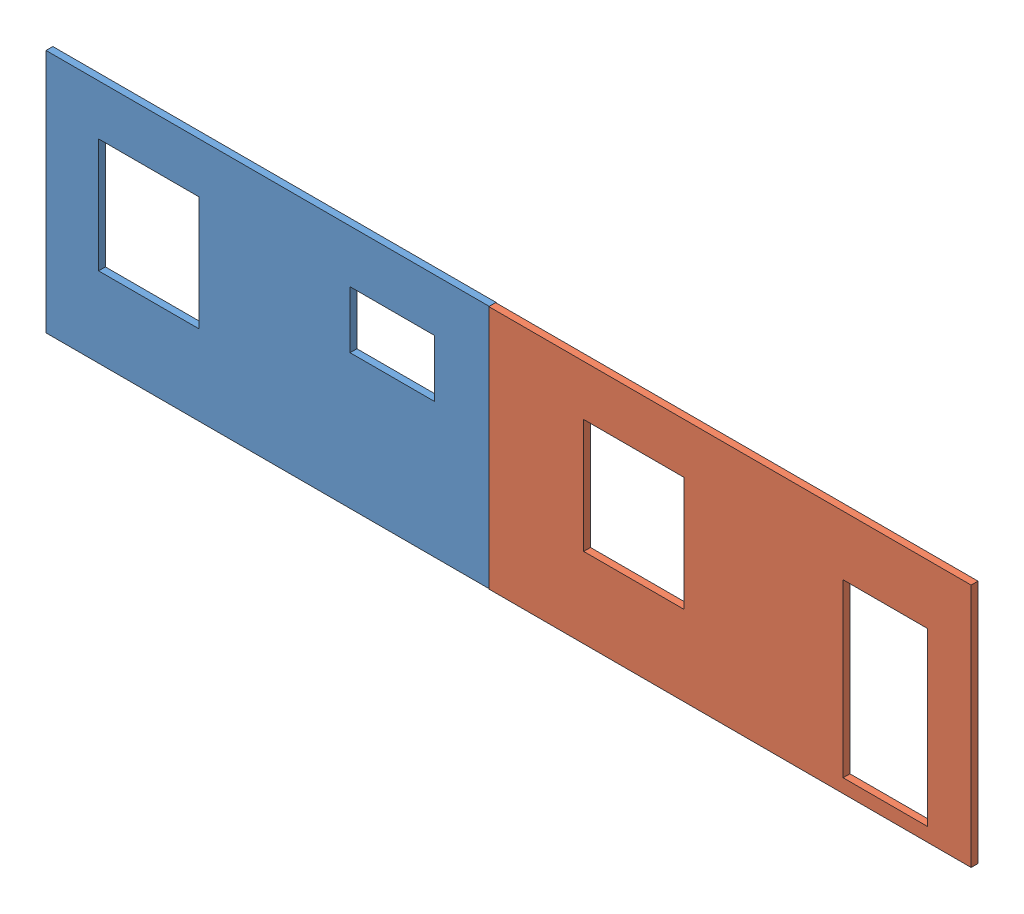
SolidWorks assembly Assemblage_ar.SLDASM, configuration Défaut (file format 3400). Lengths in mm.
Overall size (405.44 107.56 3.75).
2 component instances, 2 part files, 0 mates.
Components (placement in the parent):
- doublage_AR-G-1: doublage_AR-G.SLDPRT [Défaut] at (-175.6761 -67.5433 -1.5) size (194 107 3)
- doublage_AR-D-1: doublage_AR-D.SLDPRT [Défaut] at (18.7626 -66.9799 -0.75) size (211 107 3)
